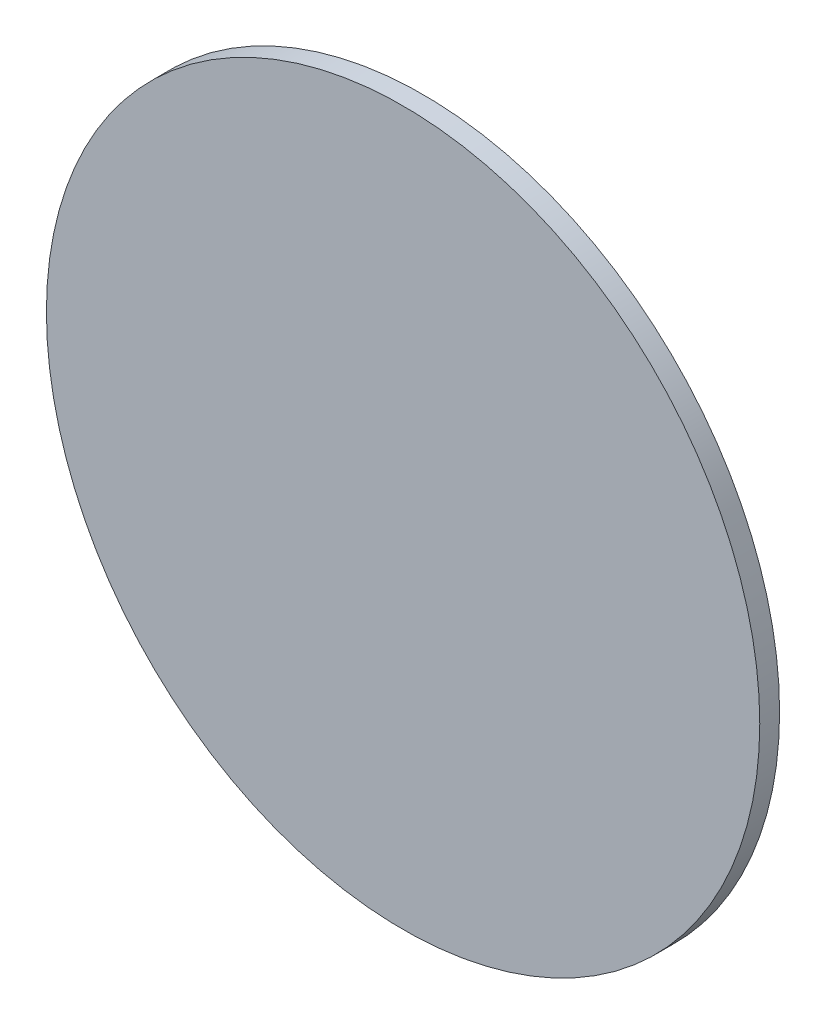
ISO-10303-21;
HEADER;
FILE_DESCRIPTION(('STEP AP214'),'2;1');
FILE_NAME('part.step','',(''),(''),'','','');
FILE_SCHEMA(('AUTOMOTIVE_DESIGN { 1 0 10303 214 1 1 1 1 }'));
ENDSEC;
DATA;
#1=APPLICATION_CONTEXT('core data for automotive mechanical design processes');
#2=APPLICATION_PROTOCOL_DEFINITION('international standard','automotive_design',2000,#1);
#3=PRODUCT_CONTEXT('',#1,'mechanical');
#4=PRODUCT('Part','Part','',(#3));
#5=PRODUCT_RELATED_PRODUCT_CATEGORY('part','',(#4));
#6=PRODUCT_DEFINITION_FORMATION('','',#4);
#7=PRODUCT_DEFINITION_CONTEXT('part definition',#1,'design');
#8=PRODUCT_DEFINITION('design','',#6,#7);
#9=PRODUCT_DEFINITION_SHAPE('','',#8);
#10=(LENGTH_UNIT() NAMED_UNIT(*) SI_UNIT(.MILLI.,.METRE.));
#11=(NAMED_UNIT(*) PLANE_ANGLE_UNIT() SI_UNIT($,.RADIAN.));
#12=(NAMED_UNIT(*) SI_UNIT($,.STERADIAN.) SOLID_ANGLE_UNIT());
#13=UNCERTAINTY_MEASURE_WITH_UNIT(LENGTH_MEASURE(1.E-05),#10,'distance_accuracy_value','');
#14=(GEOMETRIC_REPRESENTATION_CONTEXT(3) GLOBAL_UNCERTAINTY_ASSIGNED_CONTEXT((#13)) GLOBAL_UNIT_ASSIGNED_CONTEXT((#10,
#11,#12)) REPRESENTATION_CONTEXT('',''));
#15=CARTESIAN_POINT('',(0.,0.,0.));
#16=DIRECTION('',(0.,0.,1.));
#17=DIRECTION('',(1.,0.,0.));
#18=AXIS2_PLACEMENT_3D('',#15,#16,#17);
#19=CARTESIAN_POINT('',(0.,0.,1.5));
#20=DIRECTION('',(0.,0.,-1.));
#21=DIRECTION('',(-1.,0.,0.));
#22=AXIS2_PLACEMENT_3D('',#19,#20,#21);
#23=CYLINDRICAL_SURFACE('',#22,27.);
#24=CARTESIAN_POINT('',(0.,0.,1.5));
#25=DIRECTION('',(0.,0.,1.));
#26=DIRECTION('',(1.,0.,0.));
#27=AXIS2_PLACEMENT_3D('',#24,#25,#26);
#28=CIRCLE('',#27,27.);
#29=CARTESIAN_POINT('',(27.,0.,1.5));
#30=VERTEX_POINT('',#29);
#31=EDGE_CURVE('E10',#30,#30,#28,.T.);
#32=ORIENTED_EDGE('',*,*,#31,.F.);
#33=EDGE_LOOP('',(#32));
#34=FACE_BOUND('',#33,.T.);
#35=CARTESIAN_POINT('',(0.,0.,0.));
#36=DIRECTION('',(0.,0.,1.));
#37=DIRECTION('',(1.,0.,0.));
#38=AXIS2_PLACEMENT_3D('',#35,#36,#37);
#39=CIRCLE('',#38,27.);
#40=CARTESIAN_POINT('',(27.,0.,0.));
#41=VERTEX_POINT('',#40);
#42=EDGE_CURVE('E42',#41,#41,#39,.T.);
#43=ORIENTED_EDGE('',*,*,#42,.T.);
#44=EDGE_LOOP('',(#43));
#45=FACE_BOUND('',#44,.T.);
#46=ADVANCED_FACE('F39',(#34,#45),#23,.T.);
#47=CARTESIAN_POINT('',(0.,0.,1.5));
#48=DIRECTION('',(0.,0.,1.));
#49=DIRECTION('',(1.,0.,0.));
#50=AXIS2_PLACEMENT_3D('',#47,#48,#49);
#51=PLANE('',#50);
#52=ORIENTED_EDGE('',*,*,#31,.T.);
#53=EDGE_LOOP('',(#52));
#54=FACE_BOUND('',#53,.T.);
#55=ADVANCED_FACE('F54',(#54),#51,.T.);
#56=CARTESIAN_POINT('',(0.,0.,0.));
#57=DIRECTION('',(0.,0.,1.));
#58=DIRECTION('',(1.,0.,0.));
#59=AXIS2_PLACEMENT_3D('',#56,#57,#58);
#60=PLANE('',#59);
#61=ORIENTED_EDGE('',*,*,#42,.F.);
#62=EDGE_LOOP('',(#61));
#63=FACE_BOUND('',#62,.T.);
#64=ADVANCED_FACE('F52',(#63),#60,.F.);
#65=CLOSED_SHELL('',(#46,#55,#64));
#66=MANIFOLD_SOLID_BREP('B2',#65);
#67=ADVANCED_BREP_SHAPE_REPRESENTATION('',(#18,#66),#14);
#68=SHAPE_DEFINITION_REPRESENTATION(#9,#67);
ENDSEC;
END-ISO-10303-21;
